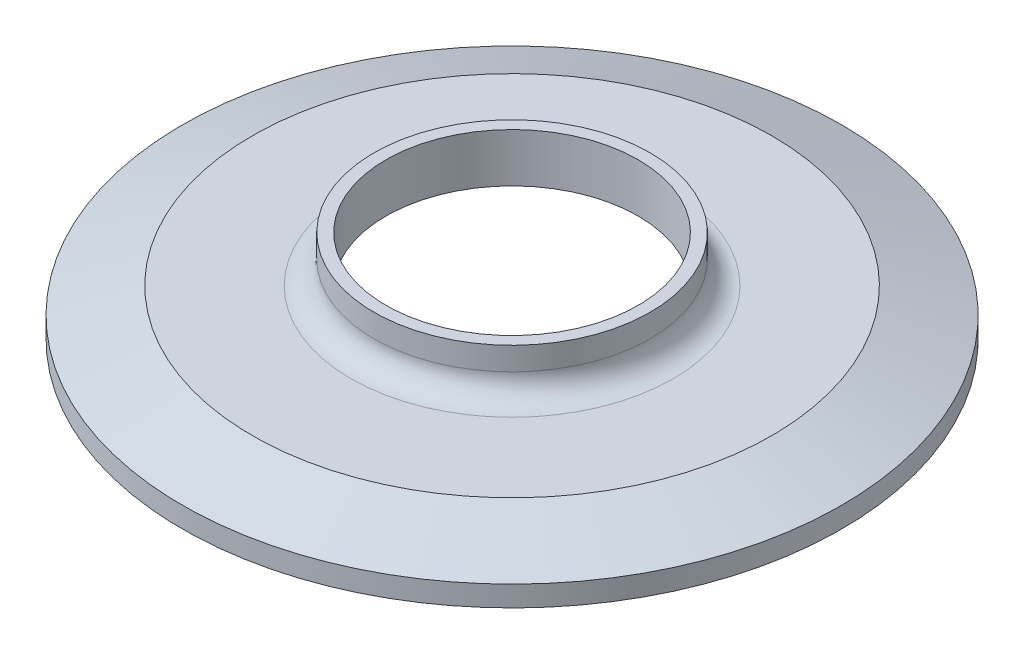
ISO-10303-21;
HEADER;
FILE_DESCRIPTION(('STEP AP214'),'2;1');
FILE_NAME('part.step','',(''),(''),'','','');
FILE_SCHEMA(('AUTOMOTIVE_DESIGN { 1 0 10303 214 1 1 1 1 }'));
ENDSEC;
DATA;
#1=APPLICATION_CONTEXT('core data for automotive mechanical design processes');
#2=APPLICATION_PROTOCOL_DEFINITION('international standard','automotive_design',2000,#1);
#3=PRODUCT_CONTEXT('',#1,'mechanical');
#4=PRODUCT('Part','Part','',(#3));
#5=PRODUCT_RELATED_PRODUCT_CATEGORY('part','',(#4));
#6=PRODUCT_DEFINITION_FORMATION('','',#4);
#7=PRODUCT_DEFINITION_CONTEXT('part definition',#1,'design');
#8=PRODUCT_DEFINITION('design','',#6,#7);
#9=PRODUCT_DEFINITION_SHAPE('','',#8);
#10=(LENGTH_UNIT() NAMED_UNIT(*) SI_UNIT(.MILLI.,.METRE.));
#11=(NAMED_UNIT(*) PLANE_ANGLE_UNIT() SI_UNIT($,.RADIAN.));
#12=(NAMED_UNIT(*) SI_UNIT($,.STERADIAN.) SOLID_ANGLE_UNIT());
#13=UNCERTAINTY_MEASURE_WITH_UNIT(LENGTH_MEASURE(1.E-05),#10,'distance_accuracy_value','');
#14=(GEOMETRIC_REPRESENTATION_CONTEXT(3) GLOBAL_UNCERTAINTY_ASSIGNED_CONTEXT((#13)) GLOBAL_UNIT_ASSIGNED_CONTEXT((#10,
#11,#12)) REPRESENTATION_CONTEXT('',''));
#15=CARTESIAN_POINT('',(0.,0.,0.));
#16=DIRECTION('',(0.,0.,1.));
#17=DIRECTION('',(1.,0.,0.));
#18=AXIS2_PLACEMENT_3D('',#15,#16,#17);
#19=CARTESIAN_POINT('',(-17.399,12.7,0.));
#20=DIRECTION('',(0.,-1.,0.));
#21=DIRECTION('',(0.,0.,-1.));
#22=AXIS2_PLACEMENT_3D('',#19,#20,#21);
#23=PLANE('',#22);
#24=CARTESIAN_POINT('',(0.,12.7,0.));
#25=DIRECTION('',(0.,-1.,0.));
#26=DIRECTION('',(0.,0.,-1.));
#27=AXIS2_PLACEMENT_3D('',#24,#25,#26);
#28=CIRCLE('',#27,19.05);
#29=CARTESIAN_POINT('',(0.,12.7,-19.05));
#30=VERTEX_POINT('',#29);
#31=EDGE_CURVE('E12',#30,#30,#28,.T.);
#32=ORIENTED_EDGE('',*,*,#31,.F.);
#33=EDGE_LOOP('',(#32));
#34=FACE_BOUND('',#33,.T.);
#35=CARTESIAN_POINT('',(0.,12.7,0.));
#36=DIRECTION('',(0.,-1.,0.));
#37=DIRECTION('',(0.,0.,-1.));
#38=AXIS2_PLACEMENT_3D('',#35,#36,#37);
#39=CIRCLE('',#38,17.399);
#40=CARTESIAN_POINT('',(0.,12.7,-17.399));
#41=VERTEX_POINT('',#40);
#42=EDGE_CURVE('E87',#41,#41,#39,.T.);
#43=ORIENTED_EDGE('',*,*,#42,.T.);
#44=EDGE_LOOP('',(#43));
#45=FACE_BOUND('',#44,.T.);
#46=ADVANCED_FACE('F38',(#34,#45),#23,.F.);
#47=CARTESIAN_POINT('',(0.,0.,0.));
#48=DIRECTION('',(0.,-1.,0.));
#49=DIRECTION('',(0.,0.,-1.));
#50=AXIS2_PLACEMENT_3D('',#47,#48,#49);
#51=CYLINDRICAL_SURFACE('',#50,19.05);
#52=CARTESIAN_POINT('',(0.,9.525,0.));
#53=DIRECTION('',(0.,-1.,0.));
#54=DIRECTION('',(0.,0.,-1.));
#55=AXIS2_PLACEMENT_3D('',#52,#53,#54);
#56=CIRCLE('',#55,19.05);
#57=CARTESIAN_POINT('',(0.,9.525,-19.05));
#58=VERTEX_POINT('',#57);
#59=EDGE_CURVE('E44',#58,#58,#56,.T.);
#60=ORIENTED_EDGE('',*,*,#59,.F.);
#61=EDGE_LOOP('',(#60));
#62=FACE_BOUND('',#61,.T.);
#63=ORIENTED_EDGE('',*,*,#31,.T.);
#64=EDGE_LOOP('',(#63));
#65=FACE_BOUND('',#64,.T.);
#66=ADVANCED_FACE('F166',(#62,#65),#51,.T.);
#67=CARTESIAN_POINT('',(0.,9.525,0.));
#68=DIRECTION('',(0.,-1.,0.));
#69=DIRECTION('',(0.,0.,-1.));
#70=AXIS2_PLACEMENT_3D('',#67,#68,#69);
#71=TOROIDAL_SURFACE('',#70,22.225,3.175);
#72=CARTESIAN_POINT('',(0.,6.34999999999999,0.));
#73=DIRECTION('',(0.,-1.,0.));
#74=DIRECTION('',(0.,0.,-1.));
#75=AXIS2_PLACEMENT_3D('',#72,#73,#74);
#76=CIRCLE('',#75,22.225);
#77=CARTESIAN_POINT('',(0.,6.34999999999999,-22.225));
#78=VERTEX_POINT('',#77);
#79=EDGE_CURVE('E48',#78,#78,#76,.T.);
#80=ORIENTED_EDGE('',*,*,#79,.F.);
#81=EDGE_LOOP('',(#80));
#82=FACE_BOUND('',#81,.T.);
#83=ORIENTED_EDGE('',*,*,#59,.T.);
#84=EDGE_LOOP('',(#83));
#85=FACE_BOUND('',#84,.T.);
#86=ADVANCED_FACE('F161',(#82,#85),#71,.F.);
#87=CARTESIAN_POINT('',(-22.225,6.35,0.));
#88=DIRECTION('',(0.,-1.,0.));
#89=DIRECTION('',(0.,0.,-1.));
#90=AXIS2_PLACEMENT_3D('',#87,#88,#89);
#91=PLANE('',#90);
#92=CARTESIAN_POINT('',(0.,6.35,0.));
#93=DIRECTION('',(0.,-1.,0.));
#94=DIRECTION('',(0.,0.,-1.));
#95=AXIS2_PLACEMENT_3D('',#92,#93,#94);
#96=CIRCLE('',#95,35.8228421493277);
#97=CARTESIAN_POINT('',(0.,6.35,-35.8228421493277));
#98=VERTEX_POINT('',#97);
#99=EDGE_CURVE('E52',#98,#98,#96,.T.);
#100=ORIENTED_EDGE('',*,*,#99,.F.);
#101=EDGE_LOOP('',(#100));
#102=FACE_BOUND('',#101,.T.);
#103=ORIENTED_EDGE('',*,*,#79,.T.);
#104=EDGE_LOOP('',(#103));
#105=FACE_BOUND('',#104,.T.);
#106=ADVANCED_FACE('F155',(#102,#105),#91,.F.);
#107=CARTESIAN_POINT('',(0.,6.35,0.));
#108=DIRECTION('',(0.,-1.,0.));
#109=DIRECTION('',(0.,0.,-1.));
#110=AXIS2_PLACEMENT_3D('',#107,#108,#109);
#111=CONICAL_SURFACE('',#110,35.8228421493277,1.22173047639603);
#112=CARTESIAN_POINT('',(0.,2.8448,0.));
#113=DIRECTION('',(0.,-1.,0.));
#114=DIRECTION('',(0.,0.,-1.));
#115=AXIS2_PLACEMENT_3D('',#112,#113,#114);
#116=CIRCLE('',#115,45.4533);
#117=CARTESIAN_POINT('',(0.,2.8448,-45.4533));
#118=VERTEX_POINT('',#117);
#119=EDGE_CURVE('E57',#118,#118,#116,.T.);
#120=ORIENTED_EDGE('',*,*,#119,.F.);
#121=EDGE_LOOP('',(#120));
#122=FACE_BOUND('',#121,.T.);
#123=ORIENTED_EDGE('',*,*,#99,.T.);
#124=EDGE_LOOP('',(#123));
#125=FACE_BOUND('',#124,.T.);
#126=ADVANCED_FACE('F149',(#122,#125),#111,.T.);
#127=CARTESIAN_POINT('',(0.,0.,0.));
#128=DIRECTION('',(0.,-1.,0.));
#129=DIRECTION('',(0.,0.,-1.));
#130=AXIS2_PLACEMENT_3D('',#127,#128,#129);
#131=CYLINDRICAL_SURFACE('',#130,45.4533);
#132=CARTESIAN_POINT('',(0.,0.,0.));
#133=DIRECTION('',(0.,-1.,0.));
#134=DIRECTION('',(0.,0.,-1.));
#135=AXIS2_PLACEMENT_3D('',#132,#133,#134);
#136=CIRCLE('',#135,45.4533);
#137=CARTESIAN_POINT('',(0.,0.,-45.4533));
#138=VERTEX_POINT('',#137);
#139=EDGE_CURVE('E60',#138,#138,#136,.T.);
#140=ORIENTED_EDGE('',*,*,#139,.F.);
#141=EDGE_LOOP('',(#140));
#142=FACE_BOUND('',#141,.T.);
#143=ORIENTED_EDGE('',*,*,#119,.T.);
#144=EDGE_LOOP('',(#143));
#145=FACE_BOUND('',#144,.T.);
#146=ADVANCED_FACE('F143',(#142,#145),#131,.T.);
#147=CARTESIAN_POINT('',(0.,0.,0.));
#148=DIRECTION('',(0.,-1.,0.));
#149=DIRECTION('',(0.,0.,-1.));
#150=AXIS2_PLACEMENT_3D('',#147,#148,#149);
#151=CONICAL_SURFACE('',#150,45.4533,1.56939586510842);
#152=CARTESIAN_POINT('',(0.,0.0025124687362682,0.));
#153=DIRECTION('',(0.,-1.,0.));
#154=DIRECTION('',(0.,0.,-1.));
#155=AXIS2_PLACEMENT_3D('',#152,#153,#154);
#156=CIRCLE('',#155,43.6592722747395);
#157=CARTESIAN_POINT('',(0.,0.0025124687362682,-43.6592722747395));
#158=VERTEX_POINT('',#157);
#159=EDGE_CURVE('E63',#158,#158,#156,.T.);
#160=ORIENTED_EDGE('',*,*,#159,.F.);
#161=EDGE_LOOP('',(#160));
#162=FACE_BOUND('',#161,.T.);
#163=ORIENTED_EDGE('',*,*,#139,.T.);
#164=EDGE_LOOP('',(#163));
#165=FACE_BOUND('',#164,.T.);
#166=ADVANCED_FACE('F137',(#162,#165),#151,.F.);
#167=CARTESIAN_POINT('',(0.,0.789912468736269,0.));
#168=DIRECTION('',(0.,-1.,0.));
#169=DIRECTION('',(0.,0.,-1.));
#170=AXIS2_PLACEMENT_3D('',#167,#168,#169);
#171=TOROIDAL_SURFACE('',#170,43.6592722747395,0.787399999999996);
#172=CARTESIAN_POINT('',(0.,0.482250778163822,0.));
#173=DIRECTION('',(0.,-1.,0.));
#174=DIRECTION('',(0.,0.,-1.));
#175=AXIS2_PLACEMENT_3D('',#172,#173,#174);
#176=CIRCLE('',#175,42.9344667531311);
#177=CARTESIAN_POINT('',(0.,0.482250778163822,-42.9344667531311));
#178=VERTEX_POINT('',#177);
#179=EDGE_CURVE('E66',#178,#178,#176,.T.);
#180=ORIENTED_EDGE('',*,*,#179,.F.);
#181=EDGE_LOOP('',(#180));
#182=FACE_BOUND('',#181,.T.);
#183=ORIENTED_EDGE('',*,*,#159,.T.);
#184=EDGE_LOOP('',(#183));
#185=FACE_BOUND('',#184,.T.);
#186=ADVANCED_FACE('F131',(#182,#185),#171,.T.);
#187=CARTESIAN_POINT('',(0.,0.482250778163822,0.));
#188=DIRECTION('',(0.,-1.,0.));
#189=DIRECTION('',(0.,0.,-1.));
#190=AXIS2_PLACEMENT_3D('',#187,#188,#189);
#191=CONICAL_SURFACE('',#190,42.9344667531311,0.401425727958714);
#192=CARTESIAN_POINT('',(0.,0.875367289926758,0.));
#193=DIRECTION('',(0.,-1.,0.));
#194=DIRECTION('',(0.,0.,-1.));
#195=AXIS2_PLACEMENT_3D('',#192,#193,#194);
#196=CIRCLE('',#195,42.7675986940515);
#197=CARTESIAN_POINT('',(0.,0.875367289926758,-42.7675986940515));
#198=VERTEX_POINT('',#197);
#199=EDGE_CURVE('E69',#198,#198,#196,.T.);
#200=ORIENTED_EDGE('',*,*,#199,.F.);
#201=EDGE_LOOP('',(#200));
#202=FACE_BOUND('',#201,.T.);
#203=ORIENTED_EDGE('',*,*,#179,.T.);
#204=EDGE_LOOP('',(#203));
#205=FACE_BOUND('',#204,.T.);
#206=ADVANCED_FACE('F125',(#202,#205),#191,.F.);
#207=CARTESIAN_POINT('',(0.,0.408912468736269,0.));
#208=DIRECTION('',(0.,-1.,0.));
#209=DIRECTION('',(0.,0.,-1.));
#210=AXIS2_PLACEMENT_3D('',#207,#208,#209);
#211=TOROIDAL_SURFACE('',#210,41.6687,1.19379999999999);
#212=CARTESIAN_POINT('',(0.,0.875367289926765,0.));
#213=DIRECTION('',(0.,-1.,0.));
#214=DIRECTION('',(0.,0.,-1.));
#215=AXIS2_PLACEMENT_3D('',#212,#213,#214);
#216=CIRCLE('',#215,40.5698013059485);
#217=CARTESIAN_POINT('',(0.,0.875367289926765,-40.5698013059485));
#218=VERTEX_POINT('',#217);
#219=EDGE_CURVE('E72',#218,#218,#216,.T.);
#220=ORIENTED_EDGE('',*,*,#219,.F.);
#221=EDGE_LOOP('',(#220));
#222=FACE_BOUND('',#221,.T.);
#223=ORIENTED_EDGE('',*,*,#199,.T.);
#224=EDGE_LOOP('',(#223));
#225=FACE_BOUND('',#224,.T.);
#226=ADVANCED_FACE('F119',(#222,#225),#211,.F.);
#227=CARTESIAN_POINT('',(0.,0.875367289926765,0.));
#228=DIRECTION('',(0.,1.,0.));
#229=DIRECTION('',(0.,0.,1.));
#230=AXIS2_PLACEMENT_3D('',#227,#228,#229);
#231=CONICAL_SURFACE('',#230,40.5698013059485,0.401425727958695);
#232=CARTESIAN_POINT('',(0.,0.482250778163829,0.));
#233=DIRECTION('',(0.,-1.,0.));
#234=DIRECTION('',(0.,0.,-1.));
#235=AXIS2_PLACEMENT_3D('',#232,#233,#234);
#236=CIRCLE('',#235,40.402933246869);
#237=CARTESIAN_POINT('',(0.,0.482250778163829,-40.402933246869));
#238=VERTEX_POINT('',#237);
#239=EDGE_CURVE('E75',#238,#238,#236,.T.);
#240=ORIENTED_EDGE('',*,*,#239,.F.);
#241=EDGE_LOOP('',(#240));
#242=FACE_BOUND('',#241,.T.);
#243=ORIENTED_EDGE('',*,*,#219,.T.);
#244=EDGE_LOOP('',(#243));
#245=FACE_BOUND('',#244,.T.);
#246=ADVANCED_FACE('F113',(#242,#245),#231,.T.);
#247=CARTESIAN_POINT('',(0.,0.789912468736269,0.));
#248=DIRECTION('',(0.,-1.,0.));
#249=DIRECTION('',(0.,0.,-1.));
#250=AXIS2_PLACEMENT_3D('',#247,#248,#249);
#251=TOROIDAL_SURFACE('',#250,39.6781277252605,0.787399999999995);
#252=CARTESIAN_POINT('',(0.,0.00251246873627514,0.));
#253=DIRECTION('',(0.,-1.,0.));
#254=DIRECTION('',(0.,0.,-1.));
#255=AXIS2_PLACEMENT_3D('',#252,#253,#254);
#256=CIRCLE('',#255,39.6781277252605);
#257=CARTESIAN_POINT('',(0.,0.00251246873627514,-39.6781277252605));
#258=VERTEX_POINT('',#257);
#259=EDGE_CURVE('E78',#258,#258,#256,.T.);
#260=ORIENTED_EDGE('',*,*,#259,.F.);
#261=EDGE_LOOP('',(#260));
#262=FACE_BOUND('',#261,.T.);
#263=ORIENTED_EDGE('',*,*,#239,.T.);
#264=EDGE_LOOP('',(#263));
#265=FACE_BOUND('',#264,.T.);
#266=ADVANCED_FACE('F107',(#262,#265),#251,.T.);
#267=CARTESIAN_POINT('',(0.,0.00251246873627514,0.));
#268=DIRECTION('',(0.,1.,0.));
#269=DIRECTION('',(0.,0.,1.));
#270=AXIS2_PLACEMENT_3D('',#267,#268,#269);
#271=CONICAL_SURFACE('',#270,39.6781277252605,1.57001826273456);
#272=CARTESIAN_POINT('',(0.,0.,0.));
#273=DIRECTION('',(0.,-1.,0.));
#274=DIRECTION('',(0.,0.,-1.));
#275=AXIS2_PLACEMENT_3D('',#272,#273,#274);
#276=CIRCLE('',#275,36.449);
#277=CARTESIAN_POINT('',(0.,0.,-36.449));
#278=VERTEX_POINT('',#277);
#279=EDGE_CURVE('E81',#278,#278,#276,.T.);
#280=ORIENTED_EDGE('',*,*,#279,.F.);
#281=EDGE_LOOP('',(#280));
#282=FACE_BOUND('',#281,.T.);
#283=ORIENTED_EDGE('',*,*,#259,.T.);
#284=EDGE_LOOP('',(#283));
#285=FACE_BOUND('',#284,.T.);
#286=ADVANCED_FACE('F101',(#282,#285),#271,.T.);
#287=CARTESIAN_POINT('',(0.,0.,0.));
#288=DIRECTION('',(0.,-1.,0.));
#289=DIRECTION('',(0.,0.,-1.));
#290=AXIS2_PLACEMENT_3D('',#287,#288,#289);
#291=CONICAL_SURFACE('',#290,36.449,1.26710903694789);
#292=CARTESIAN_POINT('',(0.,5.9699081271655,0.));
#293=DIRECTION('',(0.,-1.,0.));
#294=DIRECTION('',(0.,0.,-1.));
#295=AXIS2_PLACEMENT_3D('',#292,#293,#294);
#296=CIRCLE('',#295,17.399);
#297=CARTESIAN_POINT('',(0.,5.9699081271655,-17.399));
#298=VERTEX_POINT('',#297);
#299=EDGE_CURVE('E84',#298,#298,#296,.T.);
#300=ORIENTED_EDGE('',*,*,#299,.F.);
#301=EDGE_LOOP('',(#300));
#302=FACE_BOUND('',#301,.T.);
#303=ORIENTED_EDGE('',*,*,#279,.T.);
#304=EDGE_LOOP('',(#303));
#305=FACE_BOUND('',#304,.T.);
#306=ADVANCED_FACE('F95',(#302,#305),#291,.F.);
#307=CARTESIAN_POINT('',(0.,0.,0.));
#308=DIRECTION('',(0.,-1.,0.));
#309=DIRECTION('',(0.,0.,-1.));
#310=AXIS2_PLACEMENT_3D('',#307,#308,#309);
#311=CYLINDRICAL_SURFACE('',#310,17.399);
#312=ORIENTED_EDGE('',*,*,#42,.F.);
#313=EDGE_LOOP('',(#312));
#314=FACE_BOUND('',#313,.T.);
#315=ORIENTED_EDGE('',*,*,#299,.T.);
#316=EDGE_LOOP('',(#315));
#317=FACE_BOUND('',#316,.T.);
#318=ADVANCED_FACE('F92',(#314,#317),#311,.F.);
#319=CLOSED_SHELL('',(#46,#66,#86,#106,#126,#146,#166,#186,#206,#226,#246,#266,#286,#306,#318));
#320=MANIFOLD_SOLID_BREP('B2',#319);
#321=ADVANCED_BREP_SHAPE_REPRESENTATION('',(#18,#320),#14);
#322=SHAPE_DEFINITION_REPRESENTATION(#9,#321);
ENDSEC;
END-ISO-10303-21;
